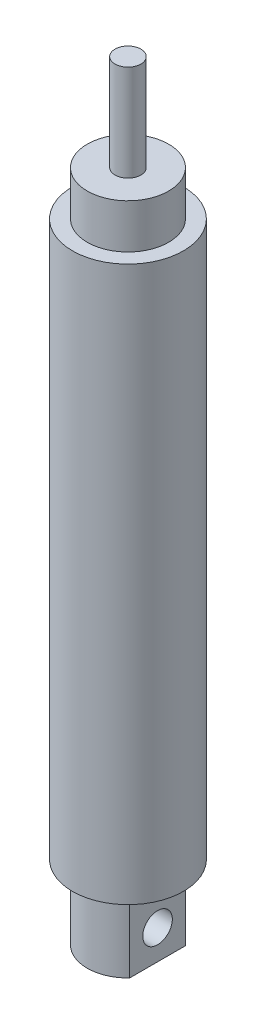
from build123d import *

# Parameters (mm, degrees)
EXTRUDE_2_DEPTH     = 20
SKETCH_4_R          = 4
CUT_EXTRUDE_1_DEPTH = 20
SKETCH_5_R          = 15
EXTRUDE_3_DEPTH     = 150
SKETCH_6_R          = 11
EXTRUDE_4_DEPTH     = 12
SKETCH_7_R          = 3.5
EXTRUDE_5_DEPTH     = 26


with BuildPart() as part:
    # Sketch 3 → Extrude 2 (new body)
    with BuildSketch(Plane(origin=(0, 0, 0), x_dir=(1, 0, 0), z_dir=(0, 1, 0))):
        with BuildLine():
            Line((8, 7.549834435), (8, -7.549834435))
            ThreePointArc((8, -7.549834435), (0, -11), (-8, -7.549834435))
            Line((-8, -7.549834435), (-8, 7.549834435))
            ThreePointArc((-8, 7.549834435), (0, 11), (8, 7.549834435))
        make_face()
    extrude(amount=EXTRUDE_2_DEPTH)

    # Sketch 4 → Cut-Extrude 1 (cut)
    with BuildSketch(Plane(origin=(8, 0, 0), x_dir=(0, 0, -1), z_dir=(1, 0, 0))):
        with Locations((0, 8)):
            Circle(SKETCH_4_R)
    extrude(amount=-CUT_EXTRUDE_1_DEPTH, mode=Mode.SUBTRACT)

    # Sketch 5 → Extrude 3 (add)
    with BuildSketch(Plane(origin=(0, 20, 0), x_dir=(1, 0, 0), z_dir=(0, 1, 0))):
        with Locations(Location((0, 0, 0), (0, 0, 270))):
            Circle(SKETCH_5_R)
    extrude(amount=EXTRUDE_3_DEPTH)

    # Sketch 6 → Extrude 4 (add)
    with BuildSketch(Plane(origin=(0, 170, 0), x_dir=(1, 0, 0), z_dir=(0, 1, 0))):
        with Locations(Location((0, 0, 0), (0, 0, 270))):
            Circle(SKETCH_6_R)
    extrude(amount=EXTRUDE_4_DEPTH)

    # Sketch 7 → Extrude 5 (add)
    with BuildSketch(Plane(origin=(0, 182, 0), x_dir=(1, 0, 0), z_dir=(0, 1, 0))):
        with Locations(Location((0, 0, 0), (0, 0, 90))):
            Circle(SKETCH_7_R)
    extrude(amount=EXTRUDE_5_DEPTH)


solid = part.part
